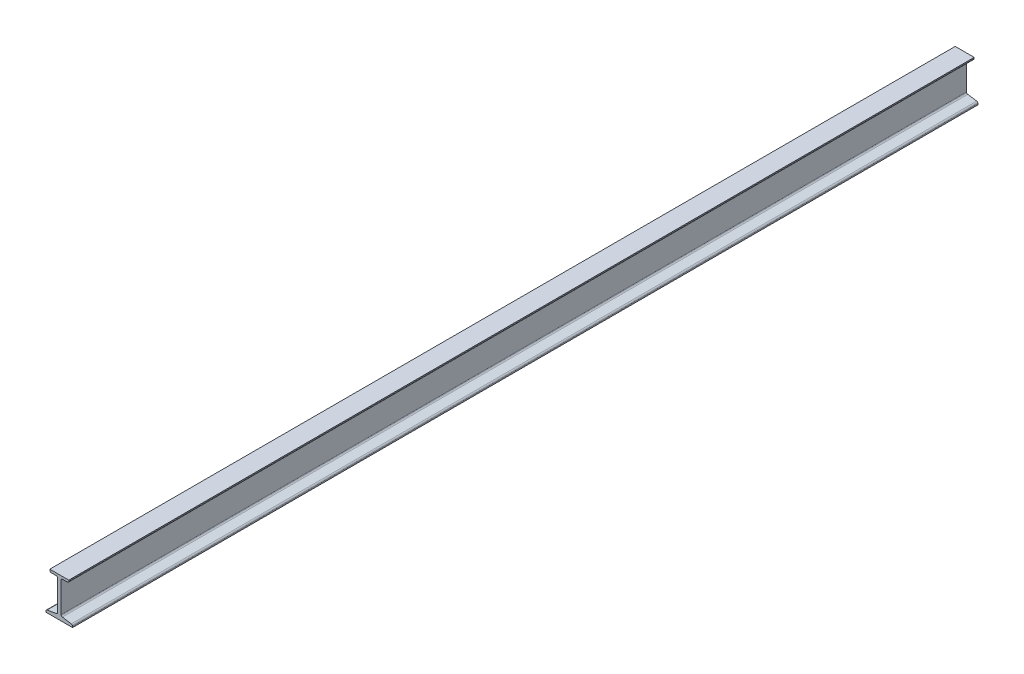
ISO-10303-21;
HEADER;
FILE_DESCRIPTION(('STEP AP214'),'2;1');
FILE_NAME('part.step','',(''),(''),'','','');
FILE_SCHEMA(('AUTOMOTIVE_DESIGN { 1 0 10303 214 1 1 1 1 }'));
ENDSEC;
DATA;
#1=APPLICATION_CONTEXT('core data for automotive mechanical design processes');
#2=APPLICATION_PROTOCOL_DEFINITION('international standard','automotive_design',2000,#1);
#3=PRODUCT_CONTEXT('',#1,'mechanical');
#4=PRODUCT('Part','Part','',(#3));
#5=PRODUCT_RELATED_PRODUCT_CATEGORY('part','',(#4));
#6=PRODUCT_DEFINITION_FORMATION('','',#4);
#7=PRODUCT_DEFINITION_CONTEXT('part definition',#1,'design');
#8=PRODUCT_DEFINITION('design','',#6,#7);
#9=PRODUCT_DEFINITION_SHAPE('','',#8);
#10=(LENGTH_UNIT() NAMED_UNIT(*) SI_UNIT(.MILLI.,.METRE.));
#11=(NAMED_UNIT(*) PLANE_ANGLE_UNIT() SI_UNIT($,.RADIAN.));
#12=(NAMED_UNIT(*) SI_UNIT($,.STERADIAN.) SOLID_ANGLE_UNIT());
#13=UNCERTAINTY_MEASURE_WITH_UNIT(LENGTH_MEASURE(1.E-05),#10,'distance_accuracy_value','');
#14=(GEOMETRIC_REPRESENTATION_CONTEXT(3) GLOBAL_UNCERTAINTY_ASSIGNED_CONTEXT((#13)) GLOBAL_UNIT_ASSIGNED_CONTEXT((#10,
#11,#12)) REPRESENTATION_CONTEXT('',''));
#15=CARTESIAN_POINT('',(0.,0.,0.));
#16=DIRECTION('',(0.,0.,1.));
#17=DIRECTION('',(1.,0.,0.));
#18=AXIS2_PLACEMENT_3D('',#15,#16,#17);
#19=CARTESIAN_POINT('',(44.,-40.7780607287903,3000.));
#20=DIRECTION('',(-1.,0.,0.));
#21=DIRECTION('',(0.,-1.,0.));
#22=AXIS2_PLACEMENT_3D('',#19,#20,#21);
#23=PLANE('',#22);
#24=DIRECTION('',(0.,1.,0.));
#25=VECTOR('',#24,1.);
#26=CARTESIAN_POINT('',(44.,-40.7780607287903,0.));
#27=LINE('',#26,#25);
#28=CARTESIAN_POINT('',(44.,-40.7780607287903,0.));
#29=VERTEX_POINT('',#28);
#30=CARTESIAN_POINT('',(44.,-37.0484641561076,0.));
#31=VERTEX_POINT('',#30);
#32=EDGE_CURVE('E177',#29,#31,#27,.T.);
#33=ORIENTED_EDGE('',*,*,#32,.T.);
#34=DIRECTION('',(0.,0.,-1.));
#35=VECTOR('',#34,1.);
#36=CARTESIAN_POINT('',(44.,-37.0484641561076,3000.));
#37=LINE('',#36,#35);
#38=CARTESIAN_POINT('',(44.,-37.0484641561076,3000.));
#39=VERTEX_POINT('',#38);
#40=EDGE_CURVE('E11',#39,#31,#37,.T.);
#41=ORIENTED_EDGE('',*,*,#40,.F.);
#42=DIRECTION('',(0.,1.,0.));
#43=VECTOR('',#42,1.);
#44=CARTESIAN_POINT('',(44.,-40.7780607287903,3000.));
#45=LINE('',#44,#43);
#46=CARTESIAN_POINT('',(44.,-40.7780607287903,3000.));
#47=VERTEX_POINT('',#46);
#48=EDGE_CURVE('E228',#47,#39,#45,.T.);
#49=ORIENTED_EDGE('',*,*,#48,.F.);
#50=DIRECTION('',(0.,0.,-1.));
#51=VECTOR('',#50,1.);
#52=CARTESIAN_POINT('',(44.,-40.7780607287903,3000.));
#53=LINE('',#52,#51);
#54=EDGE_CURVE('E190',#47,#29,#53,.T.);
#55=ORIENTED_EDGE('',*,*,#54,.T.);
#56=EDGE_LOOP('',(#33,#41,#49,#55));
#57=FACE_BOUND('',#56,.T.);
#58=ADVANCED_FACE('F37',(#57),#23,.F.);
#59=CARTESIAN_POINT('',(39.,-37.0484641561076,3000.));
#60=DIRECTION('',(0.,0.,-1.));
#61=DIRECTION('',(-1.,0.,0.));
#62=AXIS2_PLACEMENT_3D('',#59,#60,#61);
#63=CYLINDRICAL_SURFACE('',#62,5.);
#64=CARTESIAN_POINT('',(39.,-37.0484641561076,0.));
#65=DIRECTION('',(0.,0.,1.));
#66=DIRECTION('',(1.,0.,0.));
#67=AXIS2_PLACEMENT_3D('',#64,#65,#66);
#68=CIRCLE('',#67,5.);
#69=CARTESIAN_POINT('',(39.7821723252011,-32.1100224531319,0.));
#70=VERTEX_POINT('',#69);
#71=EDGE_CURVE('E173',#31,#70,#68,.T.);
#72=ORIENTED_EDGE('',*,*,#71,.T.);
#73=DIRECTION('',(0.,0.,-1.));
#74=VECTOR('',#73,1.);
#75=CARTESIAN_POINT('',(39.7821723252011,-32.1100224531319,3000.));
#76=LINE('',#75,#74);
#77=CARTESIAN_POINT('',(39.7821723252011,-32.1100224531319,3000.));
#78=VERTEX_POINT('',#77);
#79=EDGE_CURVE('E44',#78,#70,#76,.T.);
#80=ORIENTED_EDGE('',*,*,#79,.F.);
#81=CARTESIAN_POINT('',(39.,-37.0484641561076,3000.));
#82=DIRECTION('',(0.,0.,1.));
#83=DIRECTION('',(1.,0.,0.));
#84=AXIS2_PLACEMENT_3D('',#81,#82,#83);
#85=CIRCLE('',#84,5.);
#86=EDGE_CURVE('E186',#39,#78,#85,.T.);
#87=ORIENTED_EDGE('',*,*,#86,.F.);
#88=ORIENTED_EDGE('',*,*,#40,.T.);
#89=EDGE_LOOP('',(#72,#80,#87,#88));
#90=FACE_BOUND('',#89,.T.);
#91=ADVANCED_FACE('F185',(#90),#63,.T.);
#92=CARTESIAN_POINT('',(39.7821723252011,-32.1100224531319,3000.));
#93=DIRECTION('',(-0.156434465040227,-0.987688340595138,0.));
#94=DIRECTION('',(0.987688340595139,-0.156434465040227,0.));
#95=AXIS2_PLACEMENT_3D('',#92,#93,#94);
#96=PLANE('',#95);
#97=DIRECTION('',(-0.987688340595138,0.156434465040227,0.));
#98=VECTOR('',#97,1.);
#99=CARTESIAN_POINT('',(39.7821723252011,-32.1100224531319,0.));
#100=LINE('',#99,#98);
#101=CARTESIAN_POINT('',(10.2178276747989,-27.4274902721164,0.));
#102=VERTEX_POINT('',#101);
#103=EDGE_CURVE('E179',#70,#102,#100,.T.);
#104=ORIENTED_EDGE('',*,*,#103,.T.);
#105=DIRECTION('',(0.,0.,-1.));
#106=VECTOR('',#105,1.);
#107=CARTESIAN_POINT('',(10.2178276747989,-27.4274902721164,3000.));
#108=LINE('',#107,#106);
#109=CARTESIAN_POINT('',(10.2178276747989,-27.4274902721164,3000.));
#110=VERTEX_POINT('',#109);
#111=EDGE_CURVE('E318',#110,#102,#108,.T.);
#112=ORIENTED_EDGE('',*,*,#111,.F.);
#113=DIRECTION('',(-0.987688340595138,0.156434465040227,0.));
#114=VECTOR('',#113,1.);
#115=CARTESIAN_POINT('',(39.7821723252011,-32.1100224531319,3000.));
#116=LINE('',#115,#114);
#117=EDGE_CURVE('E231',#78,#110,#116,.T.);
#118=ORIENTED_EDGE('',*,*,#117,.F.);
#119=ORIENTED_EDGE('',*,*,#79,.T.);
#120=EDGE_LOOP('',(#104,#112,#118,#119));
#121=FACE_BOUND('',#120,.T.);
#122=ADVANCED_FACE('F322',(#121),#96,.F.);
#123=CARTESIAN_POINT('',(11.,-22.4890485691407,3000.));
#124=DIRECTION('',(0.,0.,-1.));
#125=DIRECTION('',(-1.,0.,0.));
#126=AXIS2_PLACEMENT_3D('',#123,#124,#125);
#127=CYLINDRICAL_SURFACE('',#126,5.);
#128=CARTESIAN_POINT('',(11.,-22.4890485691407,0.));
#129=DIRECTION('',(0.,0.,-1.));
#130=DIRECTION('',(-1.,0.,0.));
#131=AXIS2_PLACEMENT_3D('',#128,#129,#130);
#132=CIRCLE('',#131,5.);
#133=CARTESIAN_POINT('',(6.,-22.4890485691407,0.));
#134=VERTEX_POINT('',#133);
#135=EDGE_CURVE('E194',#102,#134,#132,.T.);
#136=ORIENTED_EDGE('',*,*,#135,.T.);
#137=DIRECTION('',(0.,0.,-1.));
#138=VECTOR('',#137,1.);
#139=CARTESIAN_POINT('',(6.,-22.4890485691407,3000.));
#140=LINE('',#139,#138);
#141=CARTESIAN_POINT('',(6.,-22.4890485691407,3000.));
#142=VERTEX_POINT('',#141);
#143=EDGE_CURVE('E315',#142,#134,#140,.T.);
#144=ORIENTED_EDGE('',*,*,#143,.F.);
#145=CARTESIAN_POINT('',(11.,-22.4890485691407,3000.));
#146=DIRECTION('',(0.,0.,-1.));
#147=DIRECTION('',(-1.,0.,0.));
#148=AXIS2_PLACEMENT_3D('',#145,#146,#147);
#149=CIRCLE('',#148,5.);
#150=EDGE_CURVE('E233',#110,#142,#149,.T.);
#151=ORIENTED_EDGE('',*,*,#150,.F.);
#152=ORIENTED_EDGE('',*,*,#111,.T.);
#153=EDGE_LOOP('',(#136,#144,#151,#152));
#154=FACE_BOUND('',#153,.T.);
#155=ADVANCED_FACE('F330',(#154),#127,.F.);
#156=CARTESIAN_POINT('',(6.,-22.4890485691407,3000.));
#157=DIRECTION('',(-1.,0.,0.));
#158=DIRECTION('',(0.,0.,1.));
#159=AXIS2_PLACEMENT_3D('',#156,#157,#158);
#160=PLANE('',#159);
#161=DIRECTION('',(0.,1.,0.));
#162=VECTOR('',#161,1.);
#163=CARTESIAN_POINT('',(6.,-22.4890485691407,0.));
#164=LINE('',#163,#162);
#165=CARTESIAN_POINT('',(6.,76.2219392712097,0.));
#166=VERTEX_POINT('',#165);
#167=EDGE_CURVE('E196',#134,#166,#164,.T.);
#168=ORIENTED_EDGE('',*,*,#167,.T.);
#169=DIRECTION('',(0.,0.,-1.));
#170=VECTOR('',#169,1.);
#171=CARTESIAN_POINT('',(6.,76.2219392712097,3000.));
#172=LINE('',#171,#170);
#173=CARTESIAN_POINT('',(6.,76.2219392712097,3000.));
#174=VERTEX_POINT('',#173);
#175=EDGE_CURVE('E312',#174,#166,#172,.T.);
#176=ORIENTED_EDGE('',*,*,#175,.F.);
#177=DIRECTION('',(0.,1.,0.));
#178=VECTOR('',#177,1.);
#179=CARTESIAN_POINT('',(6.,-22.4890485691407,3000.));
#180=LINE('',#179,#178);
#181=EDGE_CURVE('E235',#142,#174,#180,.T.);
#182=ORIENTED_EDGE('',*,*,#181,.F.);
#183=ORIENTED_EDGE('',*,*,#143,.T.);
#184=EDGE_LOOP('',(#168,#176,#182,#183));
#185=FACE_BOUND('',#184,.T.);
#186=ADVANCED_FACE('F333',(#185),#160,.F.);
#187=CARTESIAN_POINT('',(11.,76.2219392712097,3000.));
#188=DIRECTION('',(0.,0.,-1.));
#189=DIRECTION('',(-1.,0.,0.));
#190=AXIS2_PLACEMENT_3D('',#187,#188,#189);
#191=CYLINDRICAL_SURFACE('',#190,5.);
#192=CARTESIAN_POINT('',(11.,76.2219392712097,0.));
#193=DIRECTION('',(0.,0.,-1.));
#194=DIRECTION('',(-1.,0.,0.));
#195=AXIS2_PLACEMENT_3D('',#192,#193,#194);
#196=CIRCLE('',#195,5.);
#197=CARTESIAN_POINT('',(11.,81.2219392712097,0.));
#198=VERTEX_POINT('',#197);
#199=EDGE_CURVE('E198',#166,#198,#196,.T.);
#200=ORIENTED_EDGE('',*,*,#199,.T.);
#201=DIRECTION('',(0.,0.,-1.));
#202=VECTOR('',#201,1.);
#203=CARTESIAN_POINT('',(11.,81.2219392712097,3000.));
#204=LINE('',#203,#202);
#205=CARTESIAN_POINT('',(11.,81.2219392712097,3000.));
#206=VERTEX_POINT('',#205);
#207=EDGE_CURVE('E309',#206,#198,#204,.T.);
#208=ORIENTED_EDGE('',*,*,#207,.F.);
#209=CARTESIAN_POINT('',(11.,76.2219392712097,3000.));
#210=DIRECTION('',(0.,0.,-1.));
#211=DIRECTION('',(-1.,0.,0.));
#212=AXIS2_PLACEMENT_3D('',#209,#210,#211);
#213=CIRCLE('',#212,5.);
#214=EDGE_CURVE('E237',#174,#206,#213,.T.);
#215=ORIENTED_EDGE('',*,*,#214,.F.);
#216=ORIENTED_EDGE('',*,*,#175,.T.);
#217=EDGE_LOOP('',(#200,#208,#215,#216));
#218=FACE_BOUND('',#217,.T.);
#219=ADVANCED_FACE('F338',(#218),#191,.F.);
#220=CARTESIAN_POINT('',(11.,81.2219392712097,3000.));
#221=DIRECTION('',(0.,1.,0.));
#222=DIRECTION('',(0.,0.,1.));
#223=AXIS2_PLACEMENT_3D('',#220,#221,#222);
#224=PLANE('',#223);
#225=DIRECTION('',(1.,0.,0.));
#226=VECTOR('',#225,1.);
#227=CARTESIAN_POINT('',(11.,81.2219392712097,0.));
#228=LINE('',#227,#226);
#229=CARTESIAN_POINT('',(26.5,81.2219392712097,0.));
#230=VERTEX_POINT('',#229);
#231=EDGE_CURVE('E200',#198,#230,#228,.T.);
#232=ORIENTED_EDGE('',*,*,#231,.T.);
#233=DIRECTION('',(0.,0.,-1.));
#234=VECTOR('',#233,1.);
#235=CARTESIAN_POINT('',(26.5,81.2219392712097,3000.));
#236=LINE('',#235,#234);
#237=CARTESIAN_POINT('',(26.5,81.2219392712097,3000.));
#238=VERTEX_POINT('',#237);
#239=EDGE_CURVE('E305',#238,#230,#236,.T.);
#240=ORIENTED_EDGE('',*,*,#239,.F.);
#241=DIRECTION('',(1.,0.,0.));
#242=VECTOR('',#241,1.);
#243=CARTESIAN_POINT('',(11.,81.2219392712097,3000.));
#244=LINE('',#243,#242);
#245=EDGE_CURVE('E239',#206,#238,#244,.T.);
#246=ORIENTED_EDGE('',*,*,#245,.F.);
#247=ORIENTED_EDGE('',*,*,#207,.T.);
#248=EDGE_LOOP('',(#232,#240,#246,#247));
#249=FACE_BOUND('',#248,.T.);
#250=ADVANCED_FACE('F344',(#249),#224,.F.);
#251=CARTESIAN_POINT('',(26.5,86.2219392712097,3000.));
#252=DIRECTION('',(0.,0.,-1.));
#253=DIRECTION('',(-1.,0.,0.));
#254=AXIS2_PLACEMENT_3D('',#251,#252,#253);
#255=CYLINDRICAL_SURFACE('',#254,5.);
#256=CARTESIAN_POINT('',(26.5,86.2219392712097,0.));
#257=DIRECTION('',(0.,0.,1.));
#258=DIRECTION('',(1.,0.,0.));
#259=AXIS2_PLACEMENT_3D('',#256,#257,#258);
#260=CIRCLE('',#259,5.);
#261=CARTESIAN_POINT('',(31.5,86.2219392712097,0.));
#262=VERTEX_POINT('',#261);
#263=EDGE_CURVE('E202',#230,#262,#260,.T.);
#264=ORIENTED_EDGE('',*,*,#263,.T.);
#265=DIRECTION('',(0.,0.,-1.));
#266=VECTOR('',#265,1.);
#267=CARTESIAN_POINT('',(31.5,86.2219392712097,3000.));
#268=LINE('',#267,#266);
#269=CARTESIAN_POINT('',(31.5,86.2219392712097,3000.));
#270=VERTEX_POINT('',#269);
#271=EDGE_CURVE('E302',#270,#262,#268,.T.);
#272=ORIENTED_EDGE('',*,*,#271,.F.);
#273=CARTESIAN_POINT('',(26.5,86.2219392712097,3000.));
#274=DIRECTION('',(0.,0.,1.));
#275=DIRECTION('',(1.,0.,0.));
#276=AXIS2_PLACEMENT_3D('',#273,#274,#275);
#277=CIRCLE('',#276,5.);
#278=EDGE_CURVE('E241',#238,#270,#277,.T.);
#279=ORIENTED_EDGE('',*,*,#278,.F.);
#280=ORIENTED_EDGE('',*,*,#239,.T.);
#281=EDGE_LOOP('',(#264,#272,#279,#280));
#282=FACE_BOUND('',#281,.T.);
#283=ADVANCED_FACE('F348',(#282),#255,.T.);
#284=CARTESIAN_POINT('',(31.5,86.2219392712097,3000.));
#285=DIRECTION('',(-1.,0.,0.));
#286=DIRECTION('',(0.,0.,1.));
#287=AXIS2_PLACEMENT_3D('',#284,#285,#286);
#288=PLANE('',#287);
#289=DIRECTION('',(0.,1.,0.));
#290=VECTOR('',#289,1.);
#291=CARTESIAN_POINT('',(31.5,86.2219392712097,0.));
#292=LINE('',#291,#290);
#293=CARTESIAN_POINT('',(31.5,89.2219392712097,0.));
#294=VERTEX_POINT('',#293);
#295=EDGE_CURVE('E204',#262,#294,#292,.T.);
#296=ORIENTED_EDGE('',*,*,#295,.T.);
#297=DIRECTION('',(0.,0.,-1.));
#298=VECTOR('',#297,1.);
#299=CARTESIAN_POINT('',(31.5,89.2219392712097,3000.));
#300=LINE('',#299,#298);
#301=CARTESIAN_POINT('',(31.5,89.2219392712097,3000.));
#302=VERTEX_POINT('',#301);
#303=EDGE_CURVE('E298',#302,#294,#300,.T.);
#304=ORIENTED_EDGE('',*,*,#303,.F.);
#305=DIRECTION('',(0.,1.,0.));
#306=VECTOR('',#305,1.);
#307=CARTESIAN_POINT('',(31.5,86.2219392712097,3000.));
#308=LINE('',#307,#306);
#309=EDGE_CURVE('E243',#270,#302,#308,.T.);
#310=ORIENTED_EDGE('',*,*,#309,.F.);
#311=ORIENTED_EDGE('',*,*,#271,.T.);
#312=EDGE_LOOP('',(#296,#304,#310,#311));
#313=FACE_BOUND('',#312,.T.);
#314=ADVANCED_FACE('F353',(#313),#288,.F.);
#315=CARTESIAN_POINT('',(-31.5,89.2219392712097,3000.));
#316=DIRECTION('',(0.,-1.,0.));
#317=DIRECTION('',(0.,0.,-1.));
#318=AXIS2_PLACEMENT_3D('',#315,#316,#317);
#319=PLANE('',#318);
#320=DIRECTION('',(-1.,0.,0.));
#321=VECTOR('',#320,1.);
#322=CARTESIAN_POINT('',(-31.5,89.2219392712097,0.));
#323=LINE('',#322,#321);
#324=CARTESIAN_POINT('',(-31.5,89.2219392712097,0.));
#325=VERTEX_POINT('',#324);
#326=EDGE_CURVE('E206',#294,#325,#323,.T.);
#327=ORIENTED_EDGE('',*,*,#326,.T.);
#328=DIRECTION('',(0.,0.,-1.));
#329=VECTOR('',#328,1.);
#330=CARTESIAN_POINT('',(-31.5,89.2219392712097,3000.));
#331=LINE('',#330,#329);
#332=CARTESIAN_POINT('',(-31.5,89.2219392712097,3000.));
#333=VERTEX_POINT('',#332);
#334=EDGE_CURVE('E294',#333,#325,#331,.T.);
#335=ORIENTED_EDGE('',*,*,#334,.F.);
#336=DIRECTION('',(-1.,0.,0.));
#337=VECTOR('',#336,1.);
#338=CARTESIAN_POINT('',(-31.5,89.2219392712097,3000.));
#339=LINE('',#338,#337);
#340=EDGE_CURVE('E245',#302,#333,#339,.T.);
#341=ORIENTED_EDGE('',*,*,#340,.F.);
#342=ORIENTED_EDGE('',*,*,#303,.T.);
#343=EDGE_LOOP('',(#327,#335,#341,#342));
#344=FACE_BOUND('',#343,.T.);
#345=ADVANCED_FACE('F359',(#344),#319,.F.);
#346=CARTESIAN_POINT('',(-31.5,86.2219392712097,3000.));
#347=DIRECTION('',(1.,0.,0.));
#348=DIRECTION('',(0.,0.,-1.));
#349=AXIS2_PLACEMENT_3D('',#346,#347,#348);
#350=PLANE('',#349);
#351=DIRECTION('',(0.,-1.,0.));
#352=VECTOR('',#351,1.);
#353=CARTESIAN_POINT('',(-31.5,86.2219392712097,0.));
#354=LINE('',#353,#352);
#355=CARTESIAN_POINT('',(-31.5,86.2219392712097,0.));
#356=VERTEX_POINT('',#355);
#357=EDGE_CURVE('E208',#325,#356,#354,.T.);
#358=ORIENTED_EDGE('',*,*,#357,.T.);
#359=DIRECTION('',(0.,0.,-1.));
#360=VECTOR('',#359,1.);
#361=CARTESIAN_POINT('',(-31.5,86.2219392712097,3000.));
#362=LINE('',#361,#360);
#363=CARTESIAN_POINT('',(-31.5,86.2219392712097,3000.));
#364=VERTEX_POINT('',#363);
#365=EDGE_CURVE('E291',#364,#356,#362,.T.);
#366=ORIENTED_EDGE('',*,*,#365,.F.);
#367=DIRECTION('',(0.,-1.,0.));
#368=VECTOR('',#367,1.);
#369=CARTESIAN_POINT('',(-31.5,86.2219392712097,3000.));
#370=LINE('',#369,#368);
#371=EDGE_CURVE('E248',#333,#364,#370,.T.);
#372=ORIENTED_EDGE('',*,*,#371,.F.);
#373=ORIENTED_EDGE('',*,*,#334,.T.);
#374=EDGE_LOOP('',(#358,#366,#372,#373));
#375=FACE_BOUND('',#374,.T.);
#376=ADVANCED_FACE('F363',(#375),#350,.F.);
#377=CARTESIAN_POINT('',(-26.5,86.2219392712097,3000.));
#378=DIRECTION('',(0.,0.,-1.));
#379=DIRECTION('',(-1.,0.,0.));
#380=AXIS2_PLACEMENT_3D('',#377,#378,#379);
#381=CYLINDRICAL_SURFACE('',#380,5.);
#382=CARTESIAN_POINT('',(-26.5,86.2219392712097,0.));
#383=DIRECTION('',(0.,0.,1.));
#384=DIRECTION('',(-1.,0.,0.));
#385=AXIS2_PLACEMENT_3D('',#382,#383,#384);
#386=CIRCLE('',#385,5.);
#387=CARTESIAN_POINT('',(-26.5,81.2219392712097,0.));
#388=VERTEX_POINT('',#387);
#389=EDGE_CURVE('E210',#356,#388,#386,.T.);
#390=ORIENTED_EDGE('',*,*,#389,.T.);
#391=DIRECTION('',(0.,0.,-1.));
#392=VECTOR('',#391,1.);
#393=CARTESIAN_POINT('',(-26.5,81.2219392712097,3000.));
#394=LINE('',#393,#392);
#395=CARTESIAN_POINT('',(-26.5,81.2219392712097,3000.));
#396=VERTEX_POINT('',#395);
#397=EDGE_CURVE('E288',#396,#388,#394,.T.);
#398=ORIENTED_EDGE('',*,*,#397,.F.);
#399=CARTESIAN_POINT('',(-26.5,86.2219392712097,3000.));
#400=DIRECTION('',(0.,0.,1.));
#401=DIRECTION('',(-1.,0.,0.));
#402=AXIS2_PLACEMENT_3D('',#399,#400,#401);
#403=CIRCLE('',#402,5.);
#404=EDGE_CURVE('E250',#364,#396,#403,.T.);
#405=ORIENTED_EDGE('',*,*,#404,.F.);
#406=ORIENTED_EDGE('',*,*,#365,.T.);
#407=EDGE_LOOP('',(#390,#398,#405,#406));
#408=FACE_BOUND('',#407,.T.);
#409=ADVANCED_FACE('F368',(#408),#381,.T.);
#410=CARTESIAN_POINT('',(-11.,81.2219392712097,3000.));
#411=DIRECTION('',(0.,1.,0.));
#412=DIRECTION('',(0.,0.,1.));
#413=AXIS2_PLACEMENT_3D('',#410,#411,#412);
#414=PLANE('',#413);
#415=DIRECTION('',(1.,0.,0.));
#416=VECTOR('',#415,1.);
#417=CARTESIAN_POINT('',(-11.,81.2219392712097,0.));
#418=LINE('',#417,#416);
#419=CARTESIAN_POINT('',(-11.,81.2219392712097,0.));
#420=VERTEX_POINT('',#419);
#421=EDGE_CURVE('E212',#388,#420,#418,.T.);
#422=ORIENTED_EDGE('',*,*,#421,.T.);
#423=DIRECTION('',(0.,0.,-1.));
#424=VECTOR('',#423,1.);
#425=CARTESIAN_POINT('',(-11.,81.2219392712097,3000.));
#426=LINE('',#425,#424);
#427=CARTESIAN_POINT('',(-11.,81.2219392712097,3000.));
#428=VERTEX_POINT('',#427);
#429=EDGE_CURVE('E285',#428,#420,#426,.T.);
#430=ORIENTED_EDGE('',*,*,#429,.F.);
#431=DIRECTION('',(1.,0.,0.));
#432=VECTOR('',#431,1.);
#433=CARTESIAN_POINT('',(-11.,81.2219392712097,3000.));
#434=LINE('',#433,#432);
#435=EDGE_CURVE('E252',#396,#428,#434,.T.);
#436=ORIENTED_EDGE('',*,*,#435,.F.);
#437=ORIENTED_EDGE('',*,*,#397,.T.);
#438=EDGE_LOOP('',(#422,#430,#436,#437));
#439=FACE_BOUND('',#438,.T.);
#440=ADVANCED_FACE('F374',(#439),#414,.F.);
#441=CARTESIAN_POINT('',(-11.,76.2219392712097,3000.));
#442=DIRECTION('',(0.,0.,-1.));
#443=DIRECTION('',(-1.,0.,0.));
#444=AXIS2_PLACEMENT_3D('',#441,#442,#443);
#445=CYLINDRICAL_SURFACE('',#444,5.);
#446=CARTESIAN_POINT('',(-11.,76.2219392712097,0.));
#447=DIRECTION('',(0.,0.,-1.));
#448=DIRECTION('',(1.,0.,0.));
#449=AXIS2_PLACEMENT_3D('',#446,#447,#448);
#450=CIRCLE('',#449,5.);
#451=CARTESIAN_POINT('',(-6.,76.2219392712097,0.));
#452=VERTEX_POINT('',#451);
#453=EDGE_CURVE('E214',#420,#452,#450,.T.);
#454=ORIENTED_EDGE('',*,*,#453,.T.);
#455=DIRECTION('',(0.,0.,-1.));
#456=VECTOR('',#455,1.);
#457=CARTESIAN_POINT('',(-6.,76.2219392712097,3000.));
#458=LINE('',#457,#456);
#459=CARTESIAN_POINT('',(-6.,76.2219392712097,3000.));
#460=VERTEX_POINT('',#459);
#461=EDGE_CURVE('E282',#460,#452,#458,.T.);
#462=ORIENTED_EDGE('',*,*,#461,.F.);
#463=CARTESIAN_POINT('',(-11.,76.2219392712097,3000.));
#464=DIRECTION('',(0.,0.,-1.));
#465=DIRECTION('',(1.,0.,0.));
#466=AXIS2_PLACEMENT_3D('',#463,#464,#465);
#467=CIRCLE('',#466,5.);
#468=EDGE_CURVE('E254',#428,#460,#467,.T.);
#469=ORIENTED_EDGE('',*,*,#468,.F.);
#470=ORIENTED_EDGE('',*,*,#429,.T.);
#471=EDGE_LOOP('',(#454,#462,#469,#470));
#472=FACE_BOUND('',#471,.T.);
#473=ADVANCED_FACE('F378',(#472),#445,.F.);
#474=CARTESIAN_POINT('',(-6.,-22.4890485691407,3000.));
#475=DIRECTION('',(1.,0.,0.));
#476=DIRECTION('',(0.,0.,-1.));
#477=AXIS2_PLACEMENT_3D('',#474,#475,#476);
#478=PLANE('',#477);
#479=DIRECTION('',(0.,-1.,0.));
#480=VECTOR('',#479,1.);
#481=CARTESIAN_POINT('',(-6.,-22.4890485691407,0.));
#482=LINE('',#481,#480);
#483=CARTESIAN_POINT('',(-6.,-22.4890485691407,0.));
#484=VERTEX_POINT('',#483);
#485=EDGE_CURVE('E216',#452,#484,#482,.T.);
#486=ORIENTED_EDGE('',*,*,#485,.T.);
#487=DIRECTION('',(0.,0.,-1.));
#488=VECTOR('',#487,1.);
#489=CARTESIAN_POINT('',(-6.,-22.4890485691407,3000.));
#490=LINE('',#489,#488);
#491=CARTESIAN_POINT('',(-6.,-22.4890485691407,3000.));
#492=VERTEX_POINT('',#491);
#493=EDGE_CURVE('E279',#492,#484,#490,.T.);
#494=ORIENTED_EDGE('',*,*,#493,.F.);
#495=DIRECTION('',(0.,-1.,0.));
#496=VECTOR('',#495,1.);
#497=CARTESIAN_POINT('',(-6.,-22.4890485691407,3000.));
#498=LINE('',#497,#496);
#499=EDGE_CURVE('E256',#460,#492,#498,.T.);
#500=ORIENTED_EDGE('',*,*,#499,.F.);
#501=ORIENTED_EDGE('',*,*,#461,.T.);
#502=EDGE_LOOP('',(#486,#494,#500,#501));
#503=FACE_BOUND('',#502,.T.);
#504=ADVANCED_FACE('F383',(#503),#478,.F.);
#505=CARTESIAN_POINT('',(-11.,-22.4890485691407,3000.));
#506=DIRECTION('',(0.,0.,-1.));
#507=DIRECTION('',(-1.,0.,0.));
#508=AXIS2_PLACEMENT_3D('',#505,#506,#507);
#509=CYLINDRICAL_SURFACE('',#508,5.);
#510=CARTESIAN_POINT('',(-11.,-22.4890485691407,0.));
#511=DIRECTION('',(0.,0.,-1.));
#512=DIRECTION('',(1.,0.,0.));
#513=AXIS2_PLACEMENT_3D('',#510,#511,#512);
#514=CIRCLE('',#513,5.);
#515=CARTESIAN_POINT('',(-10.2178276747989,-27.4274902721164,0.));
#516=VERTEX_POINT('',#515);
#517=EDGE_CURVE('E218',#484,#516,#514,.T.);
#518=ORIENTED_EDGE('',*,*,#517,.T.);
#519=DIRECTION('',(0.,0.,-1.));
#520=VECTOR('',#519,1.);
#521=CARTESIAN_POINT('',(-10.2178276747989,-27.4274902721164,3000.));
#522=LINE('',#521,#520);
#523=CARTESIAN_POINT('',(-10.2178276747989,-27.4274902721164,3000.));
#524=VERTEX_POINT('',#523);
#525=EDGE_CURVE('E276',#524,#516,#522,.T.);
#526=ORIENTED_EDGE('',*,*,#525,.F.);
#527=CARTESIAN_POINT('',(-11.,-22.4890485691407,3000.));
#528=DIRECTION('',(0.,0.,-1.));
#529=DIRECTION('',(1.,0.,0.));
#530=AXIS2_PLACEMENT_3D('',#527,#528,#529);
#531=CIRCLE('',#530,5.);
#532=EDGE_CURVE('E258',#492,#524,#531,.T.);
#533=ORIENTED_EDGE('',*,*,#532,.F.);
#534=ORIENTED_EDGE('',*,*,#493,.T.);
#535=EDGE_LOOP('',(#518,#526,#533,#534));
#536=FACE_BOUND('',#535,.T.);
#537=ADVANCED_FACE('F389',(#536),#509,.F.);
#538=CARTESIAN_POINT('',(-39.7821723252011,-32.1100224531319,3000.));
#539=DIRECTION('',(0.156434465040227,-0.987688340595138,0.));
#540=DIRECTION('',(0.987688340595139,0.156434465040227,0.));
#541=AXIS2_PLACEMENT_3D('',#538,#539,#540);
#542=PLANE('',#541);
#543=DIRECTION('',(-0.987688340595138,-0.156434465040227,0.));
#544=VECTOR('',#543,1.);
#545=CARTESIAN_POINT('',(-39.7821723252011,-32.1100224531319,0.));
#546=LINE('',#545,#544);
#547=CARTESIAN_POINT('',(-39.7821723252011,-32.1100224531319,0.));
#548=VERTEX_POINT('',#547);
#549=EDGE_CURVE('E220',#516,#548,#546,.T.);
#550=ORIENTED_EDGE('',*,*,#549,.T.);
#551=DIRECTION('',(0.,0.,-1.));
#552=VECTOR('',#551,1.);
#553=CARTESIAN_POINT('',(-39.7821723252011,-32.1100224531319,3000.));
#554=LINE('',#553,#552);
#555=CARTESIAN_POINT('',(-39.7821723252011,-32.1100224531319,3000.));
#556=VERTEX_POINT('',#555);
#557=EDGE_CURVE('E273',#556,#548,#554,.T.);
#558=ORIENTED_EDGE('',*,*,#557,.F.);
#559=DIRECTION('',(-0.987688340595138,-0.156434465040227,0.));
#560=VECTOR('',#559,1.);
#561=CARTESIAN_POINT('',(-39.7821723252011,-32.1100224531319,3000.));
#562=LINE('',#561,#560);
#563=EDGE_CURVE('E260',#524,#556,#562,.T.);
#564=ORIENTED_EDGE('',*,*,#563,.F.);
#565=ORIENTED_EDGE('',*,*,#525,.T.);
#566=EDGE_LOOP('',(#550,#558,#564,#565));
#567=FACE_BOUND('',#566,.T.);
#568=ADVANCED_FACE('F393',(#567),#542,.F.);
#569=CARTESIAN_POINT('',(-39.,-37.0484641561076,3000.));
#570=DIRECTION('',(0.,0.,-1.));
#571=DIRECTION('',(-1.,0.,0.));
#572=AXIS2_PLACEMENT_3D('',#569,#570,#571);
#573=CYLINDRICAL_SURFACE('',#572,5.);
#574=CARTESIAN_POINT('',(-39.,-37.0484641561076,0.));
#575=DIRECTION('',(0.,0.,1.));
#576=DIRECTION('',(-1.,0.,0.));
#577=AXIS2_PLACEMENT_3D('',#574,#575,#576);
#578=CIRCLE('',#577,5.);
#579=CARTESIAN_POINT('',(-44.,-37.0484641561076,0.));
#580=VERTEX_POINT('',#579);
#581=EDGE_CURVE('E222',#548,#580,#578,.T.);
#582=ORIENTED_EDGE('',*,*,#581,.T.);
#583=DIRECTION('',(0.,0.,-1.));
#584=VECTOR('',#583,1.);
#585=CARTESIAN_POINT('',(-44.,-37.0484641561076,3000.));
#586=LINE('',#585,#584);
#587=CARTESIAN_POINT('',(-44.,-37.0484641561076,3000.));
#588=VERTEX_POINT('',#587);
#589=EDGE_CURVE('E270',#588,#580,#586,.T.);
#590=ORIENTED_EDGE('',*,*,#589,.F.);
#591=CARTESIAN_POINT('',(-39.,-37.0484641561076,3000.));
#592=DIRECTION('',(0.,0.,1.));
#593=DIRECTION('',(-1.,0.,0.));
#594=AXIS2_PLACEMENT_3D('',#591,#592,#593);
#595=CIRCLE('',#594,5.);
#596=EDGE_CURVE('E262',#556,#588,#595,.T.);
#597=ORIENTED_EDGE('',*,*,#596,.F.);
#598=ORIENTED_EDGE('',*,*,#557,.T.);
#599=EDGE_LOOP('',(#582,#590,#597,#598));
#600=FACE_BOUND('',#599,.T.);
#601=ADVANCED_FACE('F398',(#600),#573,.T.);
#602=CARTESIAN_POINT('',(-44.,-40.7780607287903,3000.));
#603=DIRECTION('',(1.,0.,0.));
#604=DIRECTION('',(0.,1.,0.));
#605=AXIS2_PLACEMENT_3D('',#602,#603,#604);
#606=PLANE('',#605);
#607=DIRECTION('',(0.,-1.,0.));
#608=VECTOR('',#607,1.);
#609=CARTESIAN_POINT('',(-44.,-40.7780607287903,0.));
#610=LINE('',#609,#608);
#611=CARTESIAN_POINT('',(-44.,-40.7780607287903,0.));
#612=VERTEX_POINT('',#611);
#613=EDGE_CURVE('E224',#580,#612,#610,.T.);
#614=ORIENTED_EDGE('',*,*,#613,.T.);
#615=DIRECTION('',(0.,0.,-1.));
#616=VECTOR('',#615,1.);
#617=CARTESIAN_POINT('',(-44.,-40.7780607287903,3000.));
#618=LINE('',#617,#616);
#619=CARTESIAN_POINT('',(-44.,-40.7780607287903,3000.));
#620=VERTEX_POINT('',#619);
#621=EDGE_CURVE('E267',#620,#612,#618,.T.);
#622=ORIENTED_EDGE('',*,*,#621,.F.);
#623=DIRECTION('',(0.,-1.,0.));
#624=VECTOR('',#623,1.);
#625=CARTESIAN_POINT('',(-44.,-40.7780607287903,3000.));
#626=LINE('',#625,#624);
#627=EDGE_CURVE('E56',#588,#620,#626,.T.);
#628=ORIENTED_EDGE('',*,*,#627,.F.);
#629=ORIENTED_EDGE('',*,*,#589,.T.);
#630=EDGE_LOOP('',(#614,#622,#628,#629));
#631=FACE_BOUND('',#630,.T.);
#632=ADVANCED_FACE('F401',(#631),#606,.F.);
#633=CARTESIAN_POINT('',(-44.,-40.7780607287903,3000.));
#634=DIRECTION('',(0.,1.,0.));
#635=DIRECTION('',(0.,0.,1.));
#636=AXIS2_PLACEMENT_3D('',#633,#634,#635);
#637=PLANE('',#636);
#638=DIRECTION('',(1.,0.,0.));
#639=VECTOR('',#638,1.);
#640=CARTESIAN_POINT('',(-44.,-40.7780607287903,0.));
#641=LINE('',#640,#639);
#642=EDGE_CURVE('E226',#612,#29,#641,.T.);
#643=ORIENTED_EDGE('',*,*,#642,.T.);
#644=ORIENTED_EDGE('',*,*,#54,.F.);
#645=DIRECTION('',(1.,0.,0.));
#646=VECTOR('',#645,1.);
#647=CARTESIAN_POINT('',(-44.,-40.7780607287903,3000.));
#648=LINE('',#647,#646);
#649=EDGE_CURVE('E51',#620,#47,#648,.T.);
#650=ORIENTED_EDGE('',*,*,#649,.F.);
#651=ORIENTED_EDGE('',*,*,#621,.T.);
#652=EDGE_LOOP('',(#643,#644,#650,#651));
#653=FACE_BOUND('',#652,.T.);
#654=ADVANCED_FACE('F403',(#653),#637,.F.);
#655=CARTESIAN_POINT('',(39.,-37.0484641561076,3000.));
#656=DIRECTION('',(0.,0.,1.));
#657=DIRECTION('',(1.,0.,0.));
#658=AXIS2_PLACEMENT_3D('',#655,#656,#657);
#659=PLANE('',#658);
#660=ORIENTED_EDGE('',*,*,#48,.T.);
#661=ORIENTED_EDGE('',*,*,#86,.T.);
#662=ORIENTED_EDGE('',*,*,#117,.T.);
#663=ORIENTED_EDGE('',*,*,#150,.T.);
#664=ORIENTED_EDGE('',*,*,#181,.T.);
#665=ORIENTED_EDGE('',*,*,#214,.T.);
#666=ORIENTED_EDGE('',*,*,#245,.T.);
#667=ORIENTED_EDGE('',*,*,#278,.T.);
#668=ORIENTED_EDGE('',*,*,#309,.T.);
#669=ORIENTED_EDGE('',*,*,#340,.T.);
#670=ORIENTED_EDGE('',*,*,#371,.T.);
#671=ORIENTED_EDGE('',*,*,#404,.T.);
#672=ORIENTED_EDGE('',*,*,#435,.T.);
#673=ORIENTED_EDGE('',*,*,#468,.T.);
#674=ORIENTED_EDGE('',*,*,#499,.T.);
#675=ORIENTED_EDGE('',*,*,#532,.T.);
#676=ORIENTED_EDGE('',*,*,#563,.T.);
#677=ORIENTED_EDGE('',*,*,#596,.T.);
#678=ORIENTED_EDGE('',*,*,#627,.T.);
#679=ORIENTED_EDGE('',*,*,#649,.T.);
#680=EDGE_LOOP('',(#660,#661,#662,#663,#664,#665,#666,#667,#668,#669,#670,#671,#672,#673,#674,
#675,#676,#677,#678,#679));
#681=FACE_BOUND('',#680,.T.);
#682=ADVANCED_FACE('F325',(#681),#659,.T.);
#683=CARTESIAN_POINT('',(39.,-37.0484641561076,0.));
#684=DIRECTION('',(0.,0.,1.));
#685=DIRECTION('',(1.,0.,0.));
#686=AXIS2_PLACEMENT_3D('',#683,#684,#685);
#687=PLANE('',#686);
#688=ORIENTED_EDGE('',*,*,#32,.F.);
#689=ORIENTED_EDGE('',*,*,#642,.F.);
#690=ORIENTED_EDGE('',*,*,#613,.F.);
#691=ORIENTED_EDGE('',*,*,#581,.F.);
#692=ORIENTED_EDGE('',*,*,#549,.F.);
#693=ORIENTED_EDGE('',*,*,#517,.F.);
#694=ORIENTED_EDGE('',*,*,#485,.F.);
#695=ORIENTED_EDGE('',*,*,#453,.F.);
#696=ORIENTED_EDGE('',*,*,#421,.F.);
#697=ORIENTED_EDGE('',*,*,#389,.F.);
#698=ORIENTED_EDGE('',*,*,#357,.F.);
#699=ORIENTED_EDGE('',*,*,#326,.F.);
#700=ORIENTED_EDGE('',*,*,#295,.F.);
#701=ORIENTED_EDGE('',*,*,#263,.F.);
#702=ORIENTED_EDGE('',*,*,#231,.F.);
#703=ORIENTED_EDGE('',*,*,#199,.F.);
#704=ORIENTED_EDGE('',*,*,#167,.F.);
#705=ORIENTED_EDGE('',*,*,#135,.F.);
#706=ORIENTED_EDGE('',*,*,#103,.F.);
#707=ORIENTED_EDGE('',*,*,#71,.F.);
#708=EDGE_LOOP('',(#688,#689,#690,#691,#692,#693,#694,#695,#696,#697,#698,#699,#700,#701,#702,
#703,#704,#705,#706,#707));
#709=FACE_BOUND('',#708,.T.);
#710=ADVANCED_FACE('F174',(#709),#687,.F.);
#711=CLOSED_SHELL('',(#58,#91,#122,#155,#186,#219,#250,#283,#314,#345,#376,#409,#440,#473,#504,
#537,#568,#601,#632,#654,#682,#710));
#712=MANIFOLD_SOLID_BREP('B2',#711);
#713=ADVANCED_BREP_SHAPE_REPRESENTATION('',(#18,#712),#14);
#714=SHAPE_DEFINITION_REPRESENTATION(#9,#713);
ENDSEC;
END-ISO-10303-21;
